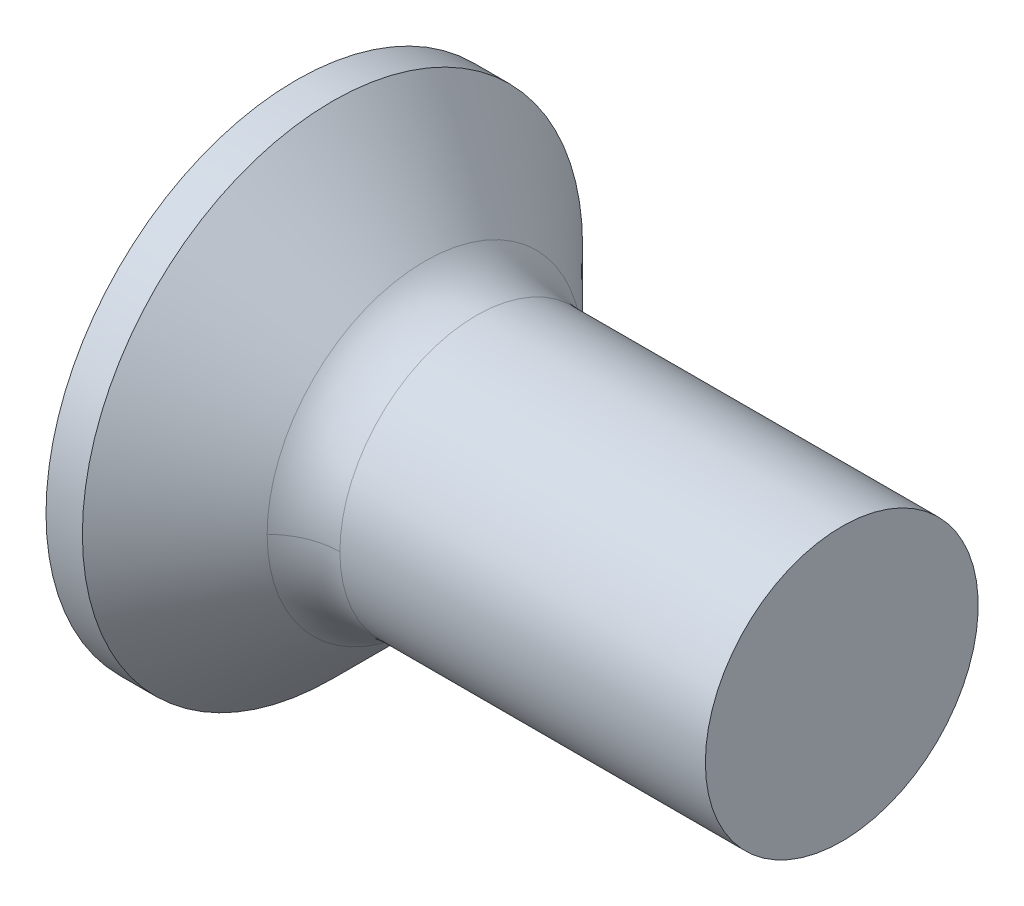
ISO-10303-21;
HEADER;
FILE_DESCRIPTION(('STEP AP214'),'2;1');
FILE_NAME('part.step','',(''),(''),'','','');
FILE_SCHEMA(('AUTOMOTIVE_DESIGN { 1 0 10303 214 1 1 1 1 }'));
ENDSEC;
DATA;
#1=APPLICATION_CONTEXT('core data for automotive mechanical design processes');
#2=APPLICATION_PROTOCOL_DEFINITION('international standard','automotive_design',2000,#1);
#3=PRODUCT_CONTEXT('',#1,'mechanical');
#4=PRODUCT('Part','Part','',(#3));
#5=PRODUCT_RELATED_PRODUCT_CATEGORY('part','',(#4));
#6=PRODUCT_DEFINITION_FORMATION('','',#4);
#7=PRODUCT_DEFINITION_CONTEXT('part definition',#1,'design');
#8=PRODUCT_DEFINITION('design','',#6,#7);
#9=PRODUCT_DEFINITION_SHAPE('','',#8);
#10=(LENGTH_UNIT() NAMED_UNIT(*) SI_UNIT(.MILLI.,.METRE.));
#11=(NAMED_UNIT(*) PLANE_ANGLE_UNIT() SI_UNIT($,.RADIAN.));
#12=(NAMED_UNIT(*) SI_UNIT($,.STERADIAN.) SOLID_ANGLE_UNIT());
#13=UNCERTAINTY_MEASURE_WITH_UNIT(LENGTH_MEASURE(1.E-05),#10,'distance_accuracy_value','');
#14=(GEOMETRIC_REPRESENTATION_CONTEXT(3) GLOBAL_UNCERTAINTY_ASSIGNED_CONTEXT((#13)) GLOBAL_UNIT_ASSIGNED_CONTEXT((#10,
#11,#12)) REPRESENTATION_CONTEXT('',''));
#15=CARTESIAN_POINT('',(0.,0.,0.));
#16=DIRECTION('',(0.,0.,1.));
#17=DIRECTION('',(1.,0.,0.));
#18=AXIS2_PLACEMENT_3D('',#15,#16,#17);
#19=CARTESIAN_POINT('',(2.01,0.,0.));
#20=DIRECTION('',(-1.,0.,0.));
#21=DIRECTION('',(0.,0.,1.));
#22=AXIS2_PLACEMENT_3D('',#19,#20,#21);
#23=CONICAL_SURFACE('',#22,0.556,0.069813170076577);
#24=CARTESIAN_POINT('',(2.01000000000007,0.,0.));
#25=DIRECTION('',(-1.,0.,0.));
#26=DIRECTION('',(-1.21680243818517E-13,0.,1.));
#27=AXIS2_PLACEMENT_3D('',#24,#25,#26);
#28=CIRCLE('',#27,0.556);
#29=CARTESIAN_POINT('',(2.01000000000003,0.370000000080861,-0.415013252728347));
#30=VERTEX_POINT('',#29);
#31=CARTESIAN_POINT('',(2.01000000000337,0.415013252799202,-0.370000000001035));
#32=VERTEX_POINT('',#31);
#33=EDGE_CURVE('E152',#30,#32,#28,.F.);
#34=ORIENTED_EDGE('',*,*,#33,.T.);
#35=CARTESIAN_POINT('',(2.93552142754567E-11,0.590157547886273,-0.369999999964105));
#36=CARTESIAN_POINT('',(0.216309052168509,0.572289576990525,-0.369999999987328));
#37=CARTESIAN_POINT('',(0.432602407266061,0.554222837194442,-0.369999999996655));
#38=CARTESIAN_POINT('',(0.865134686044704,0.517476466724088,-0.370000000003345));
#39=CARTESIAN_POINT('',(1.08137361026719,0.498796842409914,-0.370000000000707));
#40=CARTESIAN_POINT('',(1.41633940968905,0.469214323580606,-0.369999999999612));
#41=CARTESIAN_POINT('',(1.53509176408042,0.45860071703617,-0.369999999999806));
#42=CARTESIAN_POINT('',(1.77256859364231,0.437058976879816,-0.370000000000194));
#43=CARTESIAN_POINT('',(1.89129306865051,0.42613084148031,-0.370000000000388));
#44=CARTESIAN_POINT('',(2.01000000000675,0.415013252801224,-0.37));
#45=B_SPLINE_CURVE_WITH_KNOTS('',3,(#35,#36,#37,#38,#39,#40,#41,#42,#43,#44),.UNSPECIFIED.,.F.,
.F.,(4,2,2,2,4),(0.,0.651138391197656,1.30227002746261,1.65994677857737,2.01762556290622),.UNSPECIFIED.);
#46=CARTESIAN_POINT('',(0.,0.590157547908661,-0.37));
#47=VERTEX_POINT('',#46);
#48=EDGE_CURVE('E146',#47,#32,#45,.T.);
#49=ORIENTED_EDGE('',*,*,#48,.F.);
#50=CARTESIAN_POINT('',(0.,0.,0.));
#51=DIRECTION('',(-1.,0.,0.));
#52=DIRECTION('',(0.,0.,1.));
#53=AXIS2_PLACEMENT_3D('',#50,#51,#52);
#54=CIRCLE('',#53,0.696552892);
#55=CARTESIAN_POINT('',(1.36296545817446E-11,0.37,-0.590157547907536));
#56=VERTEX_POINT('',#55);
#57=EDGE_CURVE('E20',#47,#56,#54,.T.);
#58=ORIENTED_EDGE('',*,*,#57,.T.);
#59=CARTESIAN_POINT('',(2.01000000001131,0.370000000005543,-0.41501325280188));
#60=CARTESIAN_POINT('',(1.83750309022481,0.370000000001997,-0.431158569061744));
#61=CARTESIAN_POINT('',(1.66497088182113,0.370000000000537,-0.446919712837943));
#62=CARTESIAN_POINT('',(1.31985329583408,0.369999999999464,-0.477835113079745));
#63=CARTESIAN_POINT('',(1.14726791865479,0.369999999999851,-0.49298937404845));
#64=CARTESIAN_POINT('',(0.812249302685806,0.37000000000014,-0.521971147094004));
#65=CARTESIAN_POINT('',(0.649818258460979,0.37000000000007,-0.535824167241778));
#66=CARTESIAN_POINT('',(0.324928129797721,0.36999999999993,-0.563211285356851));
#67=CARTESIAN_POINT('',(0.162469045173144,0.36999999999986,-0.576745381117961));
#68=CARTESIAN_POINT('',(2.74379041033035E-11,0.37,-0.590157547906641));
#69=B_SPLINE_CURVE_WITH_KNOTS('',3,(#59,#60,#61,#62,#63,#64,#65,#66,#67,#68),.UNSPECIFIED.,.F.,
.F.,(4,2,2,2,4),(0.,0.519751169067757,1.0394984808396,1.52856030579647,2.01762551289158),.UNSPECIFIED.);
#70=EDGE_CURVE('E175',#30,#56,#69,.T.);
#71=ORIENTED_EDGE('',*,*,#70,.F.);
#72=EDGE_LOOP('',(#34,#49,#58,#71));
#73=FACE_BOUND('',#72,.T.);
#74=ADVANCED_FACE('F16',(#73),#23,.F.);
#75=CARTESIAN_POINT('',(0.,0.408503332,-0.37));
#76=DIRECTION('',(0.,0.,1.));
#77=DIRECTION('',(1.,0.,0.));
#78=AXIS2_PLACEMENT_3D('',#75,#76,#77);
#79=PLANE('',#78);
#80=DIRECTION('',(0.,1.,0.));
#81=VECTOR('',#80,1.);
#82=CARTESIAN_POINT('',(2.01,0.957506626,-0.37));
#83=LINE('',#82,#81);
#84=CARTESIAN_POINT('',(2.01000000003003,0.497851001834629,-0.37));
#85=VERTEX_POINT('',#84);
#86=EDGE_CURVE('E166',#32,#85,#83,.T.);
#87=ORIENTED_EDGE('',*,*,#86,.T.);
#88=DIRECTION('',(0.894934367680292,-0.446197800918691,0.));
#89=VECTOR('',#88,1.);
#90=CARTESIAN_POINT('',(1.005,0.998925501,-0.37));
#91=LINE('',#90,#89);
#92=CARTESIAN_POINT('',(1.56146074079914E-10,1.49999999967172,-0.37));
#93=VERTEX_POINT('',#92);
#94=EDGE_CURVE('E149',#93,#85,#91,.T.);
#95=ORIENTED_EDGE('',*,*,#94,.F.);
#96=DIRECTION('',(0.,-1.,0.));
#97=VECTOR('',#96,1.);
#98=CARTESIAN_POINT('',(0.,0.957506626,-0.37));
#99=LINE('',#98,#97);
#100=EDGE_CURVE('E141',#93,#47,#99,.T.);
#101=ORIENTED_EDGE('',*,*,#100,.T.);
#102=ORIENTED_EDGE('',*,*,#48,.T.);
#103=EDGE_LOOP('',(#87,#95,#101,#102));
#104=FACE_BOUND('',#103,.T.);
#105=ADVANCED_FACE('F144',(#104),#79,.T.);
#106=CARTESIAN_POINT('',(0.,0.37,-1.50650992));
#107=DIRECTION('',(0.,-1.,0.));
#108=DIRECTION('',(1.,0.,0.));
#109=AXIS2_PLACEMENT_3D('',#106,#107,#108);
#110=PLANE('',#109);
#111=DIRECTION('',(0.,0.,-1.));
#112=VECTOR('',#111,1.);
#113=CARTESIAN_POINT('',(0.,0.37,-0.957506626));
#114=LINE('',#113,#112);
#115=CARTESIAN_POINT('',(1.84218525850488E-10,0.37,-1.49999999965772));
#116=VERTEX_POINT('',#115);
#117=EDGE_CURVE('E161',#56,#116,#114,.T.);
#118=ORIENTED_EDGE('',*,*,#117,.T.);
#119=DIRECTION('',(-0.894934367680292,0.,-0.446197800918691));
#120=VECTOR('',#119,1.);
#121=CARTESIAN_POINT('',(1.005,0.37,-0.998925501));
#122=LINE('',#121,#120);
#123=CARTESIAN_POINT('',(2.01,0.37,-0.4978510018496));
#124=VERTEX_POINT('',#123);
#125=EDGE_CURVE('E472',#124,#116,#122,.T.);
#126=ORIENTED_EDGE('',*,*,#125,.F.);
#127=DIRECTION('',(0.,0.,1.));
#128=VECTOR('',#127,1.);
#129=CARTESIAN_POINT('',(2.01,0.37,-0.957506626));
#130=LINE('',#129,#128);
#131=EDGE_CURVE('E167',#124,#30,#130,.T.);
#132=ORIENTED_EDGE('',*,*,#131,.T.);
#133=ORIENTED_EDGE('',*,*,#70,.T.);
#134=EDGE_LOOP('',(#118,#126,#132,#133));
#135=FACE_BOUND('',#134,.T.);
#136=ADVANCED_FACE('F638',(#135),#110,.T.);
#137=CARTESIAN_POINT('',(6.,-1.518,1.518));
#138=DIRECTION('',(1.,0.,0.));
#139=DIRECTION('',(0.,0.,-1.));
#140=AXIS2_PLACEMENT_3D('',#137,#138,#139);
#141=PLANE('',#140);
#142=CARTESIAN_POINT('',(6.,0.,0.));
#143=DIRECTION('',(-1.,0.,0.));
#144=DIRECTION('',(0.,0.,1.));
#145=AXIS2_PLACEMENT_3D('',#142,#143,#144);
#146=CIRCLE('',#145,1.5);
#147=CARTESIAN_POINT('',(6.,0.,1.5));
#148=VERTEX_POINT('',#147);
#149=EDGE_CURVE('E460',#148,#148,#146,.F.);
#150=ORIENTED_EDGE('',*,*,#149,.T.);
#151=EDGE_LOOP('',(#150));
#152=FACE_BOUND('',#151,.T.);
#153=ADVANCED_FACE('F665',(#152),#141,.T.);
#154=CARTESIAN_POINT('',(0.,1.5,-0.37));
#155=DIRECTION('',(-0.446197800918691,-0.894934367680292,0.));
#156=DIRECTION('',(0.894934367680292,-0.446197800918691,0.));
#157=AXIS2_PLACEMENT_3D('',#154,#155,#156);
#158=PLANE('',#157);
#159=DIRECTION('',(0.,0.,-1.));
#160=VECTOR('',#159,1.);
#161=CARTESIAN_POINT('',(0.,1.5,0.));
#162=LINE('',#161,#160);
#163=CARTESIAN_POINT('',(0.,1.49999999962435,0.37));
#164=VERTEX_POINT('',#163);
#165=EDGE_CURVE('E484',#164,#93,#162,.T.);
#166=ORIENTED_EDGE('',*,*,#165,.T.);
#167=ORIENTED_EDGE('',*,*,#94,.T.);
#168=DIRECTION('',(0.,0.,1.));
#169=VECTOR('',#168,1.);
#170=CARTESIAN_POINT('',(2.01,0.497851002,0.));
#171=LINE('',#170,#169);
#172=CARTESIAN_POINT('',(2.01000000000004,0.49785100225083,-0.247548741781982));
#173=VERTEX_POINT('',#172);
#174=EDGE_CURVE('E486',#85,#173,#171,.T.);
#175=ORIENTED_EDGE('',*,*,#174,.T.);
#176=CARTESIAN_POINT('',(2.86902882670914,0.0695550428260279,0.));
#177=DIRECTION('',(-0.446197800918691,-0.894934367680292,0.));
#178=DIRECTION('',(-0.894934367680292,0.446197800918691,0.));
#179=AXIS2_PLACEMENT_3D('',#176,#177,#178);
#180=ELLIPSE('',#179,1.111459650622,0.491029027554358);
#181=CARTESIAN_POINT('',(2.01000000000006,0.497851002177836,0.247548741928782));
#182=VERTEX_POINT('',#181);
#183=EDGE_CURVE('E485',#173,#182,#180,.F.);
#184=ORIENTED_EDGE('',*,*,#183,.T.);
#185=DIRECTION('',(0.,0.,1.));
#186=VECTOR('',#185,1.);
#187=CARTESIAN_POINT('',(2.01,0.497851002,0.));
#188=LINE('',#187,#186);
#189=CARTESIAN_POINT('',(2.01,0.4978510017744,0.37));
#190=VERTEX_POINT('',#189);
#191=EDGE_CURVE('E482',#182,#190,#188,.T.);
#192=ORIENTED_EDGE('',*,*,#191,.T.);
#193=DIRECTION('',(0.894934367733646,-0.446197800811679,0.));
#194=VECTOR('',#193,1.);
#195=CARTESIAN_POINT('',(0.,1.49999999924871,0.37));
#196=LINE('',#195,#194);
#197=EDGE_CURVE('E455',#164,#190,#196,.T.);
#198=ORIENTED_EDGE('',*,*,#197,.F.);
#199=EDGE_LOOP('',(#166,#167,#175,#184,#192,#198));
#200=FACE_BOUND('',#199,.T.);
#201=ADVANCED_FACE('F596',(#200),#158,.T.);
#202=CARTESIAN_POINT('',(2.01,0.37,-0.497851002));
#203=DIRECTION('',(-0.446197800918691,0.,0.894934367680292));
#204=DIRECTION('',(-0.894934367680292,0.,-0.446197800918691));
#205=AXIS2_PLACEMENT_3D('',#202,#203,#204);
#206=PLANE('',#205);
#207=DIRECTION('',(0.,-1.,0.));
#208=VECTOR('',#207,1.);
#209=CARTESIAN_POINT('',(0.,0.,-1.5));
#210=LINE('',#209,#208);
#211=CARTESIAN_POINT('',(0.,-0.37,-1.49999999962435));
#212=VERTEX_POINT('',#211);
#213=EDGE_CURVE('E478',#116,#212,#210,.T.);
#214=ORIENTED_EDGE('',*,*,#213,.T.);
#215=DIRECTION('',(-0.894934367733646,0.,-0.446197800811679));
#216=VECTOR('',#215,1.);
#217=CARTESIAN_POINT('',(2.01,-0.37,-0.497851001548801));
#218=LINE('',#217,#216);
#219=CARTESIAN_POINT('',(2.01,-0.37,-0.497851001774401));
#220=VERTEX_POINT('',#219);
#221=EDGE_CURVE('E452',#220,#212,#218,.T.);
#222=ORIENTED_EDGE('',*,*,#221,.F.);
#223=DIRECTION('',(0.,1.,0.));
#224=VECTOR('',#223,1.);
#225=CARTESIAN_POINT('',(2.01,0.,-0.497851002));
#226=LINE('',#225,#224);
#227=CARTESIAN_POINT('',(2.01000000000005,-0.247548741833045,-0.49785100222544));
#228=VERTEX_POINT('',#227);
#229=EDGE_CURVE('E476',#220,#228,#226,.T.);
#230=ORIENTED_EDGE('',*,*,#229,.T.);
#231=CARTESIAN_POINT('',(2.86902882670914,0.,-0.0695550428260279));
#232=DIRECTION('',(-0.446197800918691,0.,0.894934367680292));
#233=DIRECTION('',(-0.894934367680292,0.,-0.446197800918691));
#234=AXIS2_PLACEMENT_3D('',#231,#232,#233);
#235=ELLIPSE('',#234,1.111459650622,0.491029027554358);
#236=CARTESIAN_POINT('',(2.01000000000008,0.247548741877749,-0.497851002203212));
#237=VERTEX_POINT('',#236);
#238=EDGE_CURVE('E473',#228,#237,#235,.F.);
#239=ORIENTED_EDGE('',*,*,#238,.T.);
#240=DIRECTION('',(0.,1.,0.));
#241=VECTOR('',#240,1.);
#242=CARTESIAN_POINT('',(2.01,0.,-0.497851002));
#243=LINE('',#242,#241);
#244=EDGE_CURVE('E469',#237,#124,#243,.T.);
#245=ORIENTED_EDGE('',*,*,#244,.T.);
#246=ORIENTED_EDGE('',*,*,#125,.T.);
#247=EDGE_LOOP('',(#214,#222,#230,#239,#245,#246));
#248=FACE_BOUND('',#247,.T.);
#249=ADVANCED_FACE('F190',(#248),#206,.T.);
#250=CARTESIAN_POINT('',(6.,0.,0.));
#251=DIRECTION('',(-1.,0.,0.));
#252=DIRECTION('',(0.,0.,1.));
#253=AXIS2_PLACEMENT_3D('',#250,#251,#252);
#254=CYLINDRICAL_SURFACE('',#253,1.5);
#255=ORIENTED_EDGE('',*,*,#149,.F.);
#256=EDGE_LOOP('',(#255));
#257=FACE_BOUND('',#256,.T.);
#258=CARTESIAN_POINT('',(1.98137084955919,0.,0.));
#259=DIRECTION('',(1.,0.,0.));
#260=DIRECTION('',(0.,1.,0.));
#261=AXIS2_PLACEMENT_3D('',#258,#259,#260);
#262=CIRCLE('',#261,1.50000000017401);
#263=CARTESIAN_POINT('',(1.98137084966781,-1.53827571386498E-10,-1.50000000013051));
#264=VERTEX_POINT('',#263);
#265=CARTESIAN_POINT('',(1.98137084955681,-6.73452213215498E-11,1.50000000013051));
#266=VERTEX_POINT('',#265);
#267=EDGE_CURVE('E442',#264,#266,#262,.T.);
#268=ORIENTED_EDGE('',*,*,#267,.T.);
#269=CARTESIAN_POINT('',(1.98137084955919,0.,0.));
#270=DIRECTION('',(1.,0.,0.));
#271=DIRECTION('',(0.,1.,0.));
#272=AXIS2_PLACEMENT_3D('',#269,#270,#271);
#273=CIRCLE('',#272,1.50000000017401);
#274=EDGE_CURVE('E431',#266,#264,#273,.T.);
#275=ORIENTED_EDGE('',*,*,#274,.T.);
#276=EDGE_LOOP('',(#268,#275));
#277=FACE_BOUND('',#276,.T.);
#278=ADVANCED_FACE('F185',(#257,#277),#254,.T.);
#279=CARTESIAN_POINT('',(0.,0.408503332,0.37));
#280=DIRECTION('',(0.,0.,-1.));
#281=DIRECTION('',(0.,1.,0.));
#282=AXIS2_PLACEMENT_3D('',#279,#280,#281);
#283=PLANE('',#282);
#284=DIRECTION('',(0.,1.,0.));
#285=VECTOR('',#284,1.);
#286=CARTESIAN_POINT('',(0.,0.957506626,0.37));
#287=LINE('',#286,#285);
#288=CARTESIAN_POINT('',(0.,0.590157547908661,0.37));
#289=VERTEX_POINT('',#288);
#290=EDGE_CURVE('E456',#289,#164,#287,.T.);
#291=ORIENTED_EDGE('',*,*,#290,.T.);
#292=ORIENTED_EDGE('',*,*,#197,.T.);
#293=DIRECTION('',(0.,-1.,0.));
#294=VECTOR('',#293,1.);
#295=CARTESIAN_POINT('',(2.01,0.957506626,0.37));
#296=LINE('',#295,#294);
#297=CARTESIAN_POINT('',(2.01000000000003,0.415013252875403,0.369999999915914));
#298=VERTEX_POINT('',#297);
#299=EDGE_CURVE('E458',#190,#298,#296,.T.);
#300=ORIENTED_EDGE('',*,*,#299,.T.);
#301=CARTESIAN_POINT('',(1.89001292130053E-11,0.590157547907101,0.37));
#302=CARTESIAN_POINT('',(0.216309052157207,0.572289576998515,0.37));
#303=CARTESIAN_POINT('',(0.432602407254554,0.55422283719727,0.37));
#304=CARTESIAN_POINT('',(0.86513468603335,0.517476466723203,0.37));
#305=CARTESIAN_POINT('',(1.08137361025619,0.498796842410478,0.37));
#306=CARTESIAN_POINT('',(1.41633940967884,0.469214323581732,0.37));
#307=CARTESIAN_POINT('',(1.5350917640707,0.458600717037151,0.37));
#308=CARTESIAN_POINT('',(1.77256859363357,0.437058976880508,0.37));
#309=CARTESIAN_POINT('',(1.89129306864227,0.426130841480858,0.37));
#310=CARTESIAN_POINT('',(2.00999999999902,0.415013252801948,0.37));
#311=B_SPLINE_CURVE_WITH_KNOTS('',3,(#301,#302,#303,#304,#305,#306,#307,#308,#309,#310),
.UNSPECIFIED.,.F.,.F.,(4,2,2,2,4),(0.,0.651138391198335,1.302270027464,1.65994677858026,
2.01762556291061),.UNSPECIFIED.);
#312=EDGE_CURVE('E225',#289,#298,#311,.T.);
#313=ORIENTED_EDGE('',*,*,#312,.F.);
#314=EDGE_LOOP('',(#291,#292,#300,#313));
#315=FACE_BOUND('',#314,.T.);
#316=ADVANCED_FACE('F189',(#315),#283,.T.);
#317=CARTESIAN_POINT('',(0.,-0.37,-1.50650992));
#318=DIRECTION('',(0.,1.,0.));
#319=DIRECTION('',(0.,0.,1.));
#320=AXIS2_PLACEMENT_3D('',#317,#318,#319);
#321=PLANE('',#320);
#322=DIRECTION('',(0.,0.,-1.));
#323=VECTOR('',#322,1.);
#324=CARTESIAN_POINT('',(2.01,-0.37,-0.957506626));
#325=LINE('',#324,#323);
#326=CARTESIAN_POINT('',(2.01000000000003,-0.370000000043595,-0.415013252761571));
#327=VERTEX_POINT('',#326);
#328=EDGE_CURVE('E447',#327,#220,#325,.T.);
#329=ORIENTED_EDGE('',*,*,#328,.T.);
#330=ORIENTED_EDGE('',*,*,#221,.T.);
#331=DIRECTION('',(0.,0.,1.));
#332=VECTOR('',#331,1.);
#333=CARTESIAN_POINT('',(0.,-0.37,-0.957506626));
#334=LINE('',#333,#332);
#335=CARTESIAN_POINT('',(1.31826469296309E-11,-0.37,-0.590157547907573));
#336=VERTEX_POINT('',#335);
#337=EDGE_CURVE('E453',#212,#336,#334,.T.);
#338=ORIENTED_EDGE('',*,*,#337,.T.);
#339=CARTESIAN_POINT('',(2.0100000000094,-0.369999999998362,-0.415013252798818));
#340=CARTESIAN_POINT('',(1.83750309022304,-0.36999999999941,-0.431158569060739));
#341=CARTESIAN_POINT('',(1.6649708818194,-0.369999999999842,-0.446919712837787));
#342=CARTESIAN_POINT('',(1.31985329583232,-0.370000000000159,-0.477835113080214));
#343=CARTESIAN_POINT('',(1.14726791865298,-0.370000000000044,-0.492989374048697));
#344=CARTESIAN_POINT('',(0.81224930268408,-0.369999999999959,-0.52197114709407));
#345=CARTESIAN_POINT('',(0.649818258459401,-0.369999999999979,-0.535824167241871));
#346=CARTESIAN_POINT('',(0.324928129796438,-0.370000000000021,-0.563211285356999));
#347=CARTESIAN_POINT('',(0.162469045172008,-0.370000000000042,-0.576745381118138));
#348=CARTESIAN_POINT('',(2.64376629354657E-11,-0.37,-0.590157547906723));
#349=B_SPLINE_CURVE_WITH_KNOTS('',3,(#339,#340,#341,#342,#343,#344,#345,#346,#347,#348),
.UNSPECIFIED.,.F.,.F.,(4,2,2,2,4),(0.,0.519751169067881,1.03949848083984,1.52856030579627,
2.01762551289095),.UNSPECIFIED.);
#350=EDGE_CURVE('E415',#327,#336,#349,.T.);
#351=ORIENTED_EDGE('',*,*,#350,.F.);
#352=EDGE_LOOP('',(#329,#330,#338,#351));
#353=FACE_BOUND('',#352,.T.);
#354=ADVANCED_FACE('F198',(#353),#321,.T.);
#355=CARTESIAN_POINT('',(2.061237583,0.,1.503996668));
#356=CARTESIAN_POINT('',(2.061237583,3.007993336,1.503996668));
#357=CARTESIAN_POINT('',(2.061237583,3.007993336,-1.503996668));
#358=CARTESIAN_POINT('',(2.061237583,0.,-1.503996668));
#359=CARTESIAN_POINT('',(1.788610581,0.,1.476642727));
#360=CARTESIAN_POINT('',(1.788610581,2.953285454,1.476642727));
#361=CARTESIAN_POINT('',(1.788610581,2.953285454,-1.476642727));
#362=CARTESIAN_POINT('',(1.788610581,0.,-1.476642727));
#363=CARTESIAN_POINT('',(1.535471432,0.,1.581496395));
#364=CARTESIAN_POINT('',(1.535471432,3.162992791,1.581496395));
#365=CARTESIAN_POINT('',(1.535471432,3.162992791,-1.581496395));
#366=CARTESIAN_POINT('',(1.535471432,0.,-1.581496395));
#367=CARTESIAN_POINT('',(1.362037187,0.,1.793614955));
#368=CARTESIAN_POINT('',(1.362037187,3.587229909,1.793614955));
#369=CARTESIAN_POINT('',(1.362037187,3.587229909,-1.793614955));
#370=CARTESIAN_POINT('',(1.362037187,0.,-1.793614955));
#371=(BOUNDED_SURFACE() B_SPLINE_SURFACE(3,3,((#355,#356,#357,#358),(#359,#360,#361,#362),(#363,
#364,#365,#366),(#367,#368,#369,#370)),.UNSPECIFIED.,.F.,.F.,
.F.) B_SPLINE_SURFACE_WITH_KNOTS((4,4),(4,4),(0.,1.),(0.,1.),
.UNSPECIFIED.) GEOMETRIC_REPRESENTATION_ITEM() RATIONAL_B_SPLINE_SURFACE(((1.,0.333333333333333,
0.333333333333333,1.),(0.920706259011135,0.306902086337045,0.306902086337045,0.920706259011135),
(0.920706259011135,0.306902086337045,0.306902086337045,0.920706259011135),(1.,0.333333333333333,
0.333333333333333,1.))) REPRESENTATION_ITEM('') SURFACE());
#372=CARTESIAN_POINT('',(1.41568542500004,0.,0.));
#373=DIRECTION('',(-1.,0.,0.));
#374=DIRECTION('',(0.,0.,1.));
#375=AXIS2_PLACEMENT_3D('',#372,#373,#374);
#376=CIRCLE('',#375,1.734314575);
#377=CARTESIAN_POINT('',(1.41568542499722,-5.3357079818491E-10,-1.73431457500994));
#378=VERTEX_POINT('',#377);
#379=CARTESIAN_POINT('',(1.41568542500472,-1.55730398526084E-10,1.73431457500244));
#380=VERTEX_POINT('',#379);
#381=EDGE_CURVE('E420',#378,#380,#376,.F.);
#382=CARTESIAN_POINT('',(2.061237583,0.,1.503996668));
#383=CARTESIAN_POINT('',(1.788610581,0.,1.476642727));
#384=CARTESIAN_POINT('',(1.535471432,0.,1.581496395));
#385=CARTESIAN_POINT('',(1.362037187,0.,1.793614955));
#386=(BOUNDED_CURVE() B_SPLINE_CURVE(3,(#382,#383,#384,#385),.UNSPECIFIED.,.F.,
.F.) B_SPLINE_CURVE_WITH_KNOTS((4,4),(0.,1.),
.UNSPECIFIED.) CURVE() GEOMETRIC_REPRESENTATION_ITEM() RATIONAL_B_SPLINE_CURVE((1.,
0.920706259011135,0.920706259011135,1.)) REPRESENTATION_ITEM(''));
#387=EDGE_CURVE('E436',#380,#266,#386,.F.);
#388=CARTESIAN_POINT('',(2.061237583,0.,-1.503996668));
#389=CARTESIAN_POINT('',(1.788610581,0.,-1.476642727));
#390=CARTESIAN_POINT('',(1.535471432,0.,-1.581496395));
#391=CARTESIAN_POINT('',(1.362037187,0.,-1.793614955));
#392=(BOUNDED_CURVE() B_SPLINE_CURVE(3,(#388,#389,#390,#391),.UNSPECIFIED.,.F.,
.F.) B_SPLINE_CURVE_WITH_KNOTS((4,4),(0.,1.),
.UNSPECIFIED.) CURVE() GEOMETRIC_REPRESENTATION_ITEM() RATIONAL_B_SPLINE_CURVE((1.,
0.920706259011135,0.920706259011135,1.)) REPRESENTATION_ITEM(''));
#393=EDGE_CURVE('E419',#264,#378,#392,.T.);
#394=ORIENTED_EDGE('',*,*,#381,.T.);
#395=ORIENTED_EDGE('',*,*,#387,.T.);
#396=ORIENTED_EDGE('',*,*,#267,.F.);
#397=ORIENTED_EDGE('',*,*,#393,.T.);
#398=EDGE_LOOP('',(#394,#395,#396,#397));
#399=FACE_BOUND('',#398,.T.);
#400=ADVANCED_FACE('F192',(#399),#371,.F.);
#401=CARTESIAN_POINT('',(2.061237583,0.,-1.503996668));
#402=CARTESIAN_POINT('',(2.061237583,-3.007993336,-1.503996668));
#403=CARTESIAN_POINT('',(2.061237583,-3.007993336,1.503996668));
#404=CARTESIAN_POINT('',(2.061237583,0.,1.503996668));
#405=CARTESIAN_POINT('',(1.788610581,0.,-1.476642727));
#406=CARTESIAN_POINT('',(1.788610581,-2.953285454,-1.476642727));
#407=CARTESIAN_POINT('',(1.788610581,-2.953285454,1.476642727));
#408=CARTESIAN_POINT('',(1.788610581,0.,1.476642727));
#409=CARTESIAN_POINT('',(1.535471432,0.,-1.581496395));
#410=CARTESIAN_POINT('',(1.535471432,-3.162992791,-1.581496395));
#411=CARTESIAN_POINT('',(1.535471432,-3.162992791,1.581496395));
#412=CARTESIAN_POINT('',(1.535471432,0.,1.581496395));
#413=CARTESIAN_POINT('',(1.362037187,0.,-1.793614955));
#414=CARTESIAN_POINT('',(1.362037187,-3.587229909,-1.793614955));
#415=CARTESIAN_POINT('',(1.362037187,-3.587229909,1.793614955));
#416=CARTESIAN_POINT('',(1.362037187,0.,1.793614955));
#417=(BOUNDED_SURFACE() B_SPLINE_SURFACE(3,3,((#401,#402,#403,#404),(#405,#406,#407,#408),(#409,
#410,#411,#412),(#413,#414,#415,#416)),.UNSPECIFIED.,.F.,.F.,
.F.) B_SPLINE_SURFACE_WITH_KNOTS((4,4),(4,4),(0.,1.),(0.,1.),
.UNSPECIFIED.) GEOMETRIC_REPRESENTATION_ITEM() RATIONAL_B_SPLINE_SURFACE(((1.,0.333333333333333,
0.333333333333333,1.),(0.920706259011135,0.306902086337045,0.306902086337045,0.920706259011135),
(0.920706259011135,0.306902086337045,0.306902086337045,0.920706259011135),(1.,0.333333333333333,
0.333333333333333,1.))) REPRESENTATION_ITEM('') SURFACE());
#418=CARTESIAN_POINT('',(1.41568542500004,0.,0.));
#419=DIRECTION('',(-1.,0.,0.));
#420=DIRECTION('',(0.,0.,1.));
#421=AXIS2_PLACEMENT_3D('',#418,#419,#420);
#422=CIRCLE('',#421,1.734314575);
#423=EDGE_CURVE('E408',#380,#378,#422,.F.);
#424=ORIENTED_EDGE('',*,*,#393,.F.);
#425=ORIENTED_EDGE('',*,*,#274,.F.);
#426=ORIENTED_EDGE('',*,*,#387,.F.);
#427=ORIENTED_EDGE('',*,*,#423,.T.);
#428=EDGE_LOOP('',(#424,#425,#426,#427));
#429=FACE_BOUND('',#428,.T.);
#430=ADVANCED_FACE('F197',(#429),#417,.F.);
#431=CARTESIAN_POINT('',(2.01,0.,0.));
#432=DIRECTION('',(-1.,0.,0.));
#433=DIRECTION('',(0.,0.,1.));
#434=AXIS2_PLACEMENT_3D('',#431,#432,#433);
#435=CONICAL_SURFACE('',#434,0.556,0.069813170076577);
#436=CARTESIAN_POINT('',(0.,0.,0.));
#437=DIRECTION('',(-1.,0.,0.));
#438=DIRECTION('',(0.,0.,1.));
#439=AXIS2_PLACEMENT_3D('',#436,#437,#438);
#440=CIRCLE('',#439,0.696552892);
#441=CARTESIAN_POINT('',(0.,0.37,0.590157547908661));
#442=VERTEX_POINT('',#441);
#443=EDGE_CURVE('E418',#442,#289,#440,.T.);
#444=ORIENTED_EDGE('',*,*,#443,.T.);
#445=ORIENTED_EDGE('',*,*,#312,.T.);
#446=CARTESIAN_POINT('',(2.01000000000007,0.,0.));
#447=DIRECTION('',(-1.,0.,0.));
#448=DIRECTION('',(-1.21680243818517E-13,0.,1.));
#449=AXIS2_PLACEMENT_3D('',#446,#447,#448);
#450=CIRCLE('',#449,0.556);
#451=CARTESIAN_POINT('',(2.0100000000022,0.369999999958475,0.415013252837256));
#452=VERTEX_POINT('',#451);
#453=EDGE_CURVE('E416',#298,#452,#450,.F.);
#454=ORIENTED_EDGE('',*,*,#453,.T.);
#455=CARTESIAN_POINT('',(2.75591331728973E-11,0.369999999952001,0.590157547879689));
#456=CARTESIAN_POINT('',(0.216309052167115,0.369999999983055,0.572289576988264));
#457=CARTESIAN_POINT('',(0.432602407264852,0.369999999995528,0.554222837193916));
#458=CARTESIAN_POINT('',(0.865134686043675,0.370000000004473,0.517476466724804));
#459=CARTESIAN_POINT('',(1.08137361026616,0.370000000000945,0.498796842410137));
#460=CARTESIAN_POINT('',(1.41633940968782,0.369999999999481,0.469214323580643));
#461=CARTESIAN_POINT('',(1.53509176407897,0.36999999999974,0.458600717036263));
#462=CARTESIAN_POINT('',(1.77256859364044,0.37000000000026,0.437058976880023));
#463=CARTESIAN_POINT('',(1.89129306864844,0.370000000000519,0.426130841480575));
#464=CARTESIAN_POINT('',(2.01000000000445,0.37,0.41501325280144));
#465=B_SPLINE_CURVE_WITH_KNOTS('',3,(#455,#456,#457,#458,#459,#460,#461,#462,#463,#464),
.UNSPECIFIED.,.F.,.F.,(4,2,2,2,4),(0.,0.651138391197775,1.30227002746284,1.65994677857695,
2.01762556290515),.UNSPECIFIED.);
#466=EDGE_CURVE('E233',#442,#452,#465,.T.);
#467=ORIENTED_EDGE('',*,*,#466,.F.);
#468=EDGE_LOOP('',(#444,#445,#454,#467));
#469=FACE_BOUND('',#468,.T.);
#470=ADVANCED_FACE('F209',(#469),#435,.F.);
#471=CARTESIAN_POINT('',(2.01,0.,0.));
#472=DIRECTION('',(-1.,0.,0.));
#473=DIRECTION('',(0.,0.,1.));
#474=AXIS2_PLACEMENT_3D('',#471,#472,#473);
#475=CONICAL_SURFACE('',#474,0.556,0.069813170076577);
#476=CARTESIAN_POINT('',(0.,0.,0.));
#477=DIRECTION('',(-1.,0.,0.));
#478=DIRECTION('',(0.,0.,1.));
#479=AXIS2_PLACEMENT_3D('',#476,#477,#478);
#480=CIRCLE('',#479,0.696552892);
#481=CARTESIAN_POINT('',(1.60406412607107E-11,-0.590157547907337,-0.37));
#482=VERTEX_POINT('',#481);
#483=EDGE_CURVE('E249',#336,#482,#480,.T.);
#484=ORIENTED_EDGE('',*,*,#483,.T.);
#485=CARTESIAN_POINT('',(2.01000000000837,-0.415013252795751,-0.369999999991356));
#486=CARTESIAN_POINT('',(1.83750309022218,-0.43115856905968,-0.369999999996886));
#487=CARTESIAN_POINT('',(1.66497088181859,-0.446919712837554,-0.369999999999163));
#488=CARTESIAN_POINT('',(1.31985329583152,-0.477835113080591,-0.370000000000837));
#489=CARTESIAN_POINT('',(1.14726791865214,-0.492989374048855,-0.370000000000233));
#490=CARTESIAN_POINT('',(0.812249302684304,-0.52197114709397,-0.369999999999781));
#491=CARTESIAN_POINT('',(0.649818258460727,-0.535824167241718,-0.36999999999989));
#492=CARTESIAN_POINT('',(0.324928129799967,-0.563211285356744,-0.37000000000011));
#493=CARTESIAN_POINT('',(0.162469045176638,-0.576745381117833,-0.370000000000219));
#494=CARTESIAN_POINT('',(3.21574312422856E-11,-0.590157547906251,-0.37));
#495=B_SPLINE_CURVE_WITH_KNOTS('',3,(#485,#486,#487,#488,#489,#490,#491,#492,#493,#494),
.UNSPECIFIED.,.F.,.F.,(4,2,2,2,4),(0.,0.519751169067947,1.03949848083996,1.52856030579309,
2.01762551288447),.UNSPECIFIED.);
#496=CARTESIAN_POINT('',(2.01000000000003,-0.415013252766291,-0.370000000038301));
#497=VERTEX_POINT('',#496);
#498=EDGE_CURVE('E243',#497,#482,#495,.T.);
#499=ORIENTED_EDGE('',*,*,#498,.F.);
#500=CARTESIAN_POINT('',(2.01000000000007,0.,0.));
#501=DIRECTION('',(-1.,0.,0.));
#502=DIRECTION('',(-1.21680243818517E-13,0.,1.));
#503=AXIS2_PLACEMENT_3D('',#500,#501,#502);
#504=CIRCLE('',#503,0.556);
#505=EDGE_CURVE('E413',#497,#327,#504,.F.);
#506=ORIENTED_EDGE('',*,*,#505,.T.);
#507=ORIENTED_EDGE('',*,*,#350,.T.);
#508=EDGE_LOOP('',(#484,#499,#506,#507));
#509=FACE_BOUND('',#508,.T.);
#510=ADVANCED_FACE('F219',(#509),#475,.F.);
#511=CARTESIAN_POINT('',(1.415685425,0.,0.));
#512=DIRECTION('',(-1.,0.,0.));
#513=DIRECTION('',(0.,0.,1.));
#514=AXIS2_PLACEMENT_3D('',#511,#512,#513);
#515=CONICAL_SURFACE('',#514,1.734314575,0.785398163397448);
#516=ORIENTED_EDGE('',*,*,#423,.F.);
#517=ORIENTED_EDGE('',*,*,#381,.F.);
#518=EDGE_LOOP('',(#516,#517));
#519=FACE_BOUND('',#518,.T.);
#520=CARTESIAN_POINT('',(0.4,0.,0.));
#521=DIRECTION('',(-1.,0.,0.));
#522=DIRECTION('',(0.,0.,1.));
#523=AXIS2_PLACEMENT_3D('',#520,#521,#522);
#524=CIRCLE('',#523,2.75);
#525=CARTESIAN_POINT('',(0.4,0.,2.75));
#526=VERTEX_POINT('',#525);
#527=EDGE_CURVE('E375',#526,#526,#524,.F.);
#528=ORIENTED_EDGE('',*,*,#527,.T.);
#529=EDGE_LOOP('',(#528));
#530=FACE_BOUND('',#529,.T.);
#531=ADVANCED_FACE('F255',(#519,#530),#515,.T.);
#532=CARTESIAN_POINT('',(0.,0.37,0.408503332));
#533=DIRECTION('',(0.,-1.,0.));
#534=DIRECTION('',(1.,0.,0.));
#535=AXIS2_PLACEMENT_3D('',#532,#533,#534);
#536=PLANE('',#535);
#537=DIRECTION('',(0.,0.,1.));
#538=VECTOR('',#537,1.);
#539=CARTESIAN_POINT('',(2.01,0.37,0.957506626));
#540=LINE('',#539,#538);
#541=CARTESIAN_POINT('',(2.01,0.37,0.4978510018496));
#542=VERTEX_POINT('',#541);
#543=EDGE_CURVE('E241',#452,#542,#540,.T.);
#544=ORIENTED_EDGE('',*,*,#543,.T.);
#545=DIRECTION('',(0.894934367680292,0.,-0.446197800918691));
#546=VECTOR('',#545,1.);
#547=CARTESIAN_POINT('',(1.005,0.37,0.998925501));
#548=LINE('',#547,#546);
#549=CARTESIAN_POINT('',(3.68437051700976E-10,0.370000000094,1.49999999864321));
#550=VERTEX_POINT('',#549);
#551=EDGE_CURVE('E369',#550,#542,#548,.T.);
#552=ORIENTED_EDGE('',*,*,#551,.F.);
#553=DIRECTION('',(0.,0.,-1.));
#554=VECTOR('',#553,1.);
#555=CARTESIAN_POINT('',(0.,0.37,0.957506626));
#556=LINE('',#555,#554);
#557=EDGE_CURVE('E242',#550,#442,#556,.T.);
#558=ORIENTED_EDGE('',*,*,#557,.T.);
#559=ORIENTED_EDGE('',*,*,#466,.T.);
#560=EDGE_LOOP('',(#544,#552,#558,#559));
#561=FACE_BOUND('',#560,.T.);
#562=ADVANCED_FACE('F250',(#561),#536,.T.);
#563=CARTESIAN_POINT('',(0.,-1.50650992,-0.37));
#564=DIRECTION('',(0.,0.,1.));
#565=DIRECTION('',(1.,0.,0.));
#566=AXIS2_PLACEMENT_3D('',#563,#564,#565);
#567=PLANE('',#566);
#568=DIRECTION('',(0.,-1.,0.));
#569=VECTOR('',#568,1.);
#570=CARTESIAN_POINT('',(0.,-0.957506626,-0.37));
#571=LINE('',#570,#569);
#572=CARTESIAN_POINT('',(3.68437051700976E-10,-1.49999999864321,-0.370000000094));
#573=VERTEX_POINT('',#572);
#574=EDGE_CURVE('E394',#482,#573,#571,.T.);
#575=ORIENTED_EDGE('',*,*,#574,.T.);
#576=DIRECTION('',(-0.894934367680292,-0.446197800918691,0.));
#577=VECTOR('',#576,1.);
#578=CARTESIAN_POINT('',(1.005,-0.998925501,-0.37));
#579=LINE('',#578,#577);
#580=CARTESIAN_POINT('',(2.01,-0.4978510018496,-0.37));
#581=VERTEX_POINT('',#580);
#582=EDGE_CURVE('E387',#581,#573,#579,.T.);
#583=ORIENTED_EDGE('',*,*,#582,.F.);
#584=DIRECTION('',(0.,1.,0.));
#585=VECTOR('',#584,1.);
#586=CARTESIAN_POINT('',(2.01,-0.957506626,-0.37));
#587=LINE('',#586,#585);
#588=EDGE_CURVE('E399',#581,#497,#587,.T.);
#589=ORIENTED_EDGE('',*,*,#588,.T.);
#590=ORIENTED_EDGE('',*,*,#498,.T.);
#591=EDGE_LOOP('',(#575,#583,#589,#590));
#592=FACE_BOUND('',#591,.T.);
#593=ADVANCED_FACE('F254',(#592),#567,.T.);
#594=CARTESIAN_POINT('',(0.4,0.,0.));
#595=DIRECTION('',(-1.,0.,0.));
#596=DIRECTION('',(0.,0.,1.));
#597=AXIS2_PLACEMENT_3D('',#594,#595,#596);
#598=CYLINDRICAL_SURFACE('',#597,2.75);
#599=ORIENTED_EDGE('',*,*,#527,.F.);
#600=EDGE_LOOP('',(#599));
#601=FACE_BOUND('',#600,.T.);
#602=CARTESIAN_POINT('',(0.,0.,0.));
#603=DIRECTION('',(-1.,0.,0.));
#604=DIRECTION('',(0.,0.,1.));
#605=AXIS2_PLACEMENT_3D('',#602,#603,#604);
#606=CIRCLE('',#605,2.75);
#607=CARTESIAN_POINT('',(0.,0.,2.75));
#608=VERTEX_POINT('',#607);
#609=EDGE_CURVE('E547',#608,#608,#606,.T.);
#610=ORIENTED_EDGE('',*,*,#609,.F.);
#611=EDGE_LOOP('',(#610));
#612=FACE_BOUND('',#611,.T.);
#613=ADVANCED_FACE('F261',(#601,#612),#598,.T.);
#614=CARTESIAN_POINT('',(0.,0.37,1.5));
#615=DIRECTION('',(-0.446197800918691,0.,-0.894934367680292));
#616=DIRECTION('',(0.894934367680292,0.,-0.446197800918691));
#617=AXIS2_PLACEMENT_3D('',#614,#615,#616);
#618=PLANE('',#617);
#619=DIRECTION('',(0.,-1.,0.));
#620=VECTOR('',#619,1.);
#621=CARTESIAN_POINT('',(0.,0.,1.499999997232));
#622=LINE('',#621,#620);
#623=CARTESIAN_POINT('',(0.,-0.37,1.49999999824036));
#624=VERTEX_POINT('',#623);
#625=EDGE_CURVE('E380',#550,#624,#622,.T.);
#626=ORIENTED_EDGE('',*,*,#625,.F.);
#627=ORIENTED_EDGE('',*,*,#551,.T.);
#628=DIRECTION('',(0.,-1.,0.));
#629=VECTOR('',#628,1.);
#630=CARTESIAN_POINT('',(2.01,0.308407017,0.497851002));
#631=LINE('',#630,#629);
#632=CARTESIAN_POINT('',(2.01000000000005,0.24754874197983,0.497851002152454));
#633=VERTEX_POINT('',#632);
#634=EDGE_CURVE('E390',#542,#633,#631,.T.);
#635=ORIENTED_EDGE('',*,*,#634,.T.);
#636=CARTESIAN_POINT('',(2.86902882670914,0.,0.0695550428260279));
#637=DIRECTION('',(-0.446197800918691,0.,-0.894934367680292));
#638=DIRECTION('',(-0.894934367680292,0.,0.446197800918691));
#639=AXIS2_PLACEMENT_3D('',#636,#637,#638);
#640=ELLIPSE('',#639,1.111459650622,0.491029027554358);
#641=CARTESIAN_POINT('',(2.01000000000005,-0.247548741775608,0.497851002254));
#642=VERTEX_POINT('',#641);
#643=EDGE_CURVE('E370',#633,#642,#640,.F.);
#644=ORIENTED_EDGE('',*,*,#643,.T.);
#645=DIRECTION('',(0.,-1.,0.));
#646=VECTOR('',#645,1.);
#647=CARTESIAN_POINT('',(2.01,0.,0.497851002));
#648=LINE('',#647,#646);
#649=CARTESIAN_POINT('',(2.01,-0.37,0.4978510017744));
#650=VERTEX_POINT('',#649);
#651=EDGE_CURVE('E367',#642,#650,#648,.T.);
#652=ORIENTED_EDGE('',*,*,#651,.T.);
#653=DIRECTION('',(0.894934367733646,0.,-0.446197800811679));
#654=VECTOR('',#653,1.);
#655=CARTESIAN_POINT('',(0.,-0.37,1.49999999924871));
#656=LINE('',#655,#654);
#657=EDGE_CURVE('E536',#624,#650,#656,.T.);
#658=ORIENTED_EDGE('',*,*,#657,.F.);
#659=EDGE_LOOP('',(#626,#627,#635,#644,#652,#658));
#660=FACE_BOUND('',#659,.T.);
#661=ADVANCED_FACE('F263',(#660),#618,.T.);
#662=CARTESIAN_POINT('',(2.01,-0.497851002,-0.37));
#663=DIRECTION('',(-0.446197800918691,0.894934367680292,0.));
#664=DIRECTION('',(-0.894934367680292,-0.446197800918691,0.));
#665=AXIS2_PLACEMENT_3D('',#662,#663,#664);
#666=PLANE('',#665);
#667=DIRECTION('',(0.,0.,-1.));
#668=VECTOR('',#667,1.);
#669=CARTESIAN_POINT('',(0.,-1.499999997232,0.));
#670=LINE('',#669,#668);
#671=CARTESIAN_POINT('',(0.,-1.49999999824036,0.37));
#672=VERTEX_POINT('',#671);
#673=EDGE_CURVE('E382',#672,#573,#670,.T.);
#674=ORIENTED_EDGE('',*,*,#673,.F.);
#675=DIRECTION('',(-0.894934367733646,-0.446197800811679,0.));
#676=VECTOR('',#675,1.);
#677=CARTESIAN_POINT('',(2.01,-0.497851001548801,0.37));
#678=LINE('',#677,#676);
#679=CARTESIAN_POINT('',(2.01,-0.497851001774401,0.37));
#680=VERTEX_POINT('',#679);
#681=EDGE_CURVE('E535',#680,#672,#678,.T.);
#682=ORIENTED_EDGE('',*,*,#681,.F.);
#683=DIRECTION('',(0.,0.,-1.));
#684=VECTOR('',#683,1.);
#685=CARTESIAN_POINT('',(2.01,-0.497851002,0.));
#686=LINE('',#685,#684);
#687=CARTESIAN_POINT('',(2.01000000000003,-0.497851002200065,0.247548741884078));
#688=VERTEX_POINT('',#687);
#689=EDGE_CURVE('E373',#680,#688,#686,.T.);
#690=ORIENTED_EDGE('',*,*,#689,.T.);
#691=CARTESIAN_POINT('',(2.86902882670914,-0.0695550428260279,0.));
#692=DIRECTION('',(-0.446197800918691,0.894934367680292,0.));
#693=DIRECTION('',(-0.894934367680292,-0.446197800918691,0.));
#694=AXIS2_PLACEMENT_3D('',#691,#692,#693);
#695=ELLIPSE('',#694,1.111459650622,0.491029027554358);
#696=CARTESIAN_POINT('',(2.01000000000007,-0.497851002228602,-0.247548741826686));
#697=VERTEX_POINT('',#696);
#698=EDGE_CURVE('E552',#688,#697,#695,.F.);
#699=ORIENTED_EDGE('',*,*,#698,.T.);
#700=DIRECTION('',(0.,0.,-1.));
#701=VECTOR('',#700,1.);
#702=CARTESIAN_POINT('',(2.01,-0.497851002,0.));
#703=LINE('',#702,#701);
#704=EDGE_CURVE('E391',#697,#581,#703,.T.);
#705=ORIENTED_EDGE('',*,*,#704,.T.);
#706=ORIENTED_EDGE('',*,*,#582,.T.);
#707=EDGE_LOOP('',(#674,#682,#690,#699,#705,#706));
#708=FACE_BOUND('',#707,.T.);
#709=ADVANCED_FACE('F266',(#708),#666,.T.);
#710=CARTESIAN_POINT('',(2.01,0.246814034,0.497851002));
#711=DIRECTION('',(1.,0.,0.));
#712=DIRECTION('',(0.,0.,-1.));
#713=AXIS2_PLACEMENT_3D('',#710,#711,#712);
#714=PLANE('',#713);
#715=ORIENTED_EDGE('',*,*,#634,.F.);
#716=ORIENTED_EDGE('',*,*,#543,.F.);
#717=CARTESIAN_POINT('',(2.01,0.,0.));
#718=DIRECTION('',(-1.,0.,0.));
#719=DIRECTION('',(0.,0.,1.));
#720=AXIS2_PLACEMENT_3D('',#717,#718,#719);
#721=CIRCLE('',#720,0.556);
#722=EDGE_CURVE('E620',#633,#452,#721,.T.);
#723=ORIENTED_EDGE('',*,*,#722,.F.);
#724=EDGE_LOOP('',(#715,#716,#723));
#725=FACE_BOUND('',#724,.T.);
#726=ADVANCED_FACE('F270',(#725),#714,.F.);
#727=CARTESIAN_POINT('',(2.01,0.414516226,0.37));
#728=DIRECTION('',(1.,0.,0.));
#729=DIRECTION('',(0.,0.,-1.));
#730=AXIS2_PLACEMENT_3D('',#727,#728,#729);
#731=PLANE('',#730);
#732=ORIENTED_EDGE('',*,*,#299,.F.);
#733=ORIENTED_EDGE('',*,*,#191,.F.);
#734=CARTESIAN_POINT('',(2.01,0.,0.));
#735=DIRECTION('',(-1.,0.,0.));
#736=DIRECTION('',(0.,0.,1.));
#737=AXIS2_PLACEMENT_3D('',#734,#735,#736);
#738=CIRCLE('',#737,0.556);
#739=EDGE_CURVE('E545',#298,#182,#738,.T.);
#740=ORIENTED_EDGE('',*,*,#739,.F.);
#741=EDGE_LOOP('',(#732,#733,#740));
#742=FACE_BOUND('',#741,.T.);
#743=ADVANCED_FACE('F274',(#742),#731,.F.);
#744=CARTESIAN_POINT('',(2.01,0.,0.));
#745=DIRECTION('',(-1.,0.,0.));
#746=DIRECTION('',(0.,0.,1.));
#747=AXIS2_PLACEMENT_3D('',#744,#745,#746);
#748=CONICAL_SURFACE('',#747,0.556,0.0698131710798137);
#749=CARTESIAN_POINT('',(2.01000000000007,0.,0.));
#750=DIRECTION('',(-1.,0.,0.));
#751=DIRECTION('',(-1.21680243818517E-13,0.,1.));
#752=AXIS2_PLACEMENT_3D('',#749,#750,#751);
#753=CIRCLE('',#752,0.556);
#754=EDGE_CURVE('E541',#182,#173,#753,.T.);
#755=ORIENTED_EDGE('',*,*,#754,.F.);
#756=ORIENTED_EDGE('',*,*,#183,.F.);
#757=EDGE_LOOP('',(#755,#756));
#758=FACE_BOUND('',#757,.T.);
#759=ADVANCED_FACE('F278',(#758),#748,.F.);
#760=CARTESIAN_POINT('',(2.01,0.414516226,-0.246814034));
#761=DIRECTION('',(1.,0.,0.));
#762=DIRECTION('',(0.,0.,-1.));
#763=AXIS2_PLACEMENT_3D('',#760,#761,#762);
#764=PLANE('',#763);
#765=ORIENTED_EDGE('',*,*,#174,.F.);
#766=ORIENTED_EDGE('',*,*,#86,.F.);
#767=CARTESIAN_POINT('',(2.01,0.,0.));
#768=DIRECTION('',(-1.,0.,0.));
#769=DIRECTION('',(0.,0.,1.));
#770=AXIS2_PLACEMENT_3D('',#767,#768,#769);
#771=CIRCLE('',#770,0.556);
#772=EDGE_CURVE('E544',#173,#32,#771,.T.);
#773=ORIENTED_EDGE('',*,*,#772,.F.);
#774=EDGE_LOOP('',(#765,#766,#773));
#775=FACE_BOUND('',#774,.T.);
#776=ADVANCED_FACE('F280',(#775),#764,.F.);
#777=CARTESIAN_POINT('',(2.01,0.246814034,-0.414516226));
#778=DIRECTION('',(1.,0.,0.));
#779=DIRECTION('',(0.,0.,-1.));
#780=AXIS2_PLACEMENT_3D('',#777,#778,#779);
#781=PLANE('',#780);
#782=ORIENTED_EDGE('',*,*,#131,.F.);
#783=ORIENTED_EDGE('',*,*,#244,.F.);
#784=CARTESIAN_POINT('',(2.01,0.,0.));
#785=DIRECTION('',(-1.,0.,0.));
#786=DIRECTION('',(0.,0.,1.));
#787=AXIS2_PLACEMENT_3D('',#784,#785,#786);
#788=CIRCLE('',#787,0.556);
#789=EDGE_CURVE('E630',#30,#237,#788,.T.);
#790=ORIENTED_EDGE('',*,*,#789,.F.);
#791=EDGE_LOOP('',(#782,#783,#790));
#792=FACE_BOUND('',#791,.T.);
#793=ADVANCED_FACE('F283',(#792),#781,.F.);
#794=CARTESIAN_POINT('',(0.,-2.783,-2.783));
#795=DIRECTION('',(-1.,0.,0.));
#796=DIRECTION('',(0.,0.,1.));
#797=AXIS2_PLACEMENT_3D('',#794,#795,#796);
#798=PLANE('',#797);
#799=ORIENTED_EDGE('',*,*,#557,.F.);
#800=ORIENTED_EDGE('',*,*,#625,.T.);
#801=DIRECTION('',(0.,0.,1.));
#802=VECTOR('',#801,1.);
#803=CARTESIAN_POINT('',(0.,-0.37,0.957506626));
#804=LINE('',#803,#802);
#805=CARTESIAN_POINT('',(0.,-0.37,0.590157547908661));
#806=VERTEX_POINT('',#805);
#807=EDGE_CURVE('E537',#806,#624,#804,.T.);
#808=ORIENTED_EDGE('',*,*,#807,.F.);
#809=CARTESIAN_POINT('',(0.,0.,0.));
#810=DIRECTION('',(-1.,0.,0.));
#811=DIRECTION('',(0.,0.,1.));
#812=AXIS2_PLACEMENT_3D('',#809,#810,#811);
#813=CIRCLE('',#812,0.696552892);
#814=CARTESIAN_POINT('',(8.36068489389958E-12,-0.590157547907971,0.37));
#815=VERTEX_POINT('',#814);
#816=EDGE_CURVE('E306',#815,#806,#813,.T.);
#817=ORIENTED_EDGE('',*,*,#816,.F.);
#818=DIRECTION('',(0.,1.,0.));
#819=VECTOR('',#818,1.);
#820=CARTESIAN_POINT('',(0.,-0.957506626,0.37));
#821=LINE('',#820,#819);
#822=EDGE_CURVE('E533',#672,#815,#821,.T.);
#823=ORIENTED_EDGE('',*,*,#822,.F.);
#824=ORIENTED_EDGE('',*,*,#673,.T.);
#825=ORIENTED_EDGE('',*,*,#574,.F.);
#826=ORIENTED_EDGE('',*,*,#483,.F.);
#827=ORIENTED_EDGE('',*,*,#337,.F.);
#828=ORIENTED_EDGE('',*,*,#213,.F.);
#829=ORIENTED_EDGE('',*,*,#117,.F.);
#830=ORIENTED_EDGE('',*,*,#57,.F.);
#831=ORIENTED_EDGE('',*,*,#100,.F.);
#832=ORIENTED_EDGE('',*,*,#165,.F.);
#833=ORIENTED_EDGE('',*,*,#290,.F.);
#834=ORIENTED_EDGE('',*,*,#443,.F.);
#835=EDGE_LOOP('',(#799,#800,#808,#817,#823,#824,#825,#826,#827,#828,#829,#830,#831,#832,#833,#834));
#836=FACE_BOUND('',#835,.T.);
#837=ORIENTED_EDGE('',*,*,#609,.T.);
#838=EDGE_LOOP('',(#837));
#839=FACE_BOUND('',#838,.T.);
#840=ADVANCED_FACE('F157',(#836,#839),#798,.T.);
#841=CARTESIAN_POINT('',(0.,-0.37,0.408503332));
#842=DIRECTION('',(0.,1.,0.));
#843=DIRECTION('',(0.,0.,1.));
#844=AXIS2_PLACEMENT_3D('',#841,#842,#843);
#845=PLANE('',#844);
#846=ORIENTED_EDGE('',*,*,#807,.T.);
#847=ORIENTED_EDGE('',*,*,#657,.T.);
#848=DIRECTION('',(0.,0.,-1.));
#849=VECTOR('',#848,1.);
#850=CARTESIAN_POINT('',(2.01,-0.37,0.957506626));
#851=LINE('',#850,#849);
#852=CARTESIAN_POINT('',(2.01000000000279,-0.36999999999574,0.415013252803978));
#853=VERTEX_POINT('',#852);
#854=EDGE_CURVE('E35',#650,#853,#851,.T.);
#855=ORIENTED_EDGE('',*,*,#854,.T.);
#856=CARTESIAN_POINT('',(2.12520437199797E-11,-0.369999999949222,0.590157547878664));
#857=CARTESIAN_POINT('',(0.216309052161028,-0.369999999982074,0.572289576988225));
#858=CARTESIAN_POINT('',(0.432602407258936,-0.369999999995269,0.554222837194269));
#859=CARTESIAN_POINT('',(0.865134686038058,-0.370000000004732,0.517476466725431));
#860=CARTESIAN_POINT('',(1.08137361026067,-0.370000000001,0.498796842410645));
#861=CARTESIAN_POINT('',(1.41633940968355,-0.369999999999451,0.469214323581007));
#862=CARTESIAN_POINT('',(1.5350917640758,-0.369999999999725,0.458600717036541));
#863=CARTESIAN_POINT('',(1.77256859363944,-0.370000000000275,0.437058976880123));
#864=CARTESIAN_POINT('',(1.89129306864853,-0.370000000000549,0.426130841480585));
#865=CARTESIAN_POINT('',(2.01000000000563,-0.37,0.415013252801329));
#866=B_SPLINE_CURVE_WITH_KNOTS('',3,(#856,#857,#858,#859,#860,#861,#862,#863,#864,#865),
.UNSPECIFIED.,.F.,.F.,(4,2,2,2,4),(0.,0.651138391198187,1.30227002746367,1.65994677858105,
2.01762556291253),.UNSPECIFIED.);
#867=EDGE_CURVE('E298',#806,#853,#866,.T.);
#868=ORIENTED_EDGE('',*,*,#867,.F.);
#869=EDGE_LOOP('',(#846,#847,#855,#868));
#870=FACE_BOUND('',#869,.T.);
#871=ADVANCED_FACE('F290',(#870),#845,.T.);
#872=CARTESIAN_POINT('',(0.,-1.50650992,0.37));
#873=DIRECTION('',(0.,0.,-1.));
#874=DIRECTION('',(0.,1.,0.));
#875=AXIS2_PLACEMENT_3D('',#872,#873,#874);
#876=PLANE('',#875);
#877=DIRECTION('',(0.,-1.,0.));
#878=VECTOR('',#877,1.);
#879=CARTESIAN_POINT('',(2.01,-0.456183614,0.37));
#880=LINE('',#879,#878);
#881=CARTESIAN_POINT('',(2.01000000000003,-0.415013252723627,0.370000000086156));
#882=VERTEX_POINT('',#881);
#883=EDGE_CURVE('E627',#882,#680,#880,.T.);
#884=ORIENTED_EDGE('',*,*,#883,.T.);
#885=ORIENTED_EDGE('',*,*,#681,.T.);
#886=ORIENTED_EDGE('',*,*,#822,.T.);
#887=CARTESIAN_POINT('',(2.01000000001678,-0.415013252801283,0.370000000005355));
#888=CARTESIAN_POINT('',(1.8375030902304,-0.431158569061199,0.370000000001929));
#889=CARTESIAN_POINT('',(1.66497088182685,-0.446919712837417,0.370000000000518));
#890=CARTESIAN_POINT('',(1.31985329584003,-0.477835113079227,0.369999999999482));
#891=CARTESIAN_POINT('',(1.14726791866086,-0.492989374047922,0.369999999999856));
#892=CARTESIAN_POINT('',(0.812249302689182,-0.521971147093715,0.370000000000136));
#893=CARTESIAN_POINT('',(0.649818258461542,-0.535824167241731,0.370000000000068));
#894=CARTESIAN_POINT('',(0.324928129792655,-0.563211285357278,0.369999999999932));
#895=CARTESIAN_POINT('',(0.162469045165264,-0.576745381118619,0.369999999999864));
#896=CARTESIAN_POINT('',(1.67423910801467E-11,-0.590157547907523,0.37));
#897=B_SPLINE_CURVE_WITH_KNOTS('',3,(#887,#888,#889,#890,#891,#892,#893,#894,#895,#896),
.UNSPECIFIED.,.F.,.F.,(4,2,2,2,4),(0.,0.5197511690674,1.03949848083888,1.52856030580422,
2.0176255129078),.UNSPECIFIED.);
#898=EDGE_CURVE('E305',#882,#815,#897,.T.);
#899=ORIENTED_EDGE('',*,*,#898,.F.);
#900=EDGE_LOOP('',(#884,#885,#886,#899));
#901=FACE_BOUND('',#900,.T.);
#902=ADVANCED_FACE('F294',(#901),#876,.T.);
#903=CARTESIAN_POINT('',(2.01,0.,0.));
#904=DIRECTION('',(-1.,0.,0.));
#905=DIRECTION('',(0.,0.,1.));
#906=AXIS2_PLACEMENT_3D('',#903,#904,#905);
#907=CONICAL_SURFACE('',#906,0.556,0.0698131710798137);
#908=ORIENTED_EDGE('',*,*,#238,.F.);
#909=CARTESIAN_POINT('',(2.01000000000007,0.,0.));
#910=DIRECTION('',(-1.,0.,0.));
#911=DIRECTION('',(-1.21680243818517E-13,0.,1.));
#912=AXIS2_PLACEMENT_3D('',#909,#910,#911);
#913=CIRCLE('',#912,0.556);
#914=EDGE_CURVE('E519',#237,#228,#913,.T.);
#915=ORIENTED_EDGE('',*,*,#914,.F.);
#916=EDGE_LOOP('',(#908,#915));
#917=FACE_BOUND('',#916,.T.);
#918=ADVANCED_FACE('F327',(#917),#907,.F.);
#919=CARTESIAN_POINT('',(2.01,-0.37,-0.414516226));
#920=DIRECTION('',(1.,0.,0.));
#921=DIRECTION('',(0.,0.,-1.));
#922=AXIS2_PLACEMENT_3D('',#919,#920,#921);
#923=PLANE('',#922);
#924=ORIENTED_EDGE('',*,*,#229,.F.);
#925=ORIENTED_EDGE('',*,*,#328,.F.);
#926=CARTESIAN_POINT('',(2.01,0.,0.));
#927=DIRECTION('',(-1.,0.,0.));
#928=DIRECTION('',(0.,0.,1.));
#929=AXIS2_PLACEMENT_3D('',#926,#927,#928);
#930=CIRCLE('',#929,0.556);
#931=EDGE_CURVE('E517',#228,#327,#930,.T.);
#932=ORIENTED_EDGE('',*,*,#931,.F.);
#933=EDGE_LOOP('',(#924,#925,#932));
#934=FACE_BOUND('',#933,.T.);
#935=ADVANCED_FACE('F330',(#934),#923,.F.);
#936=CARTESIAN_POINT('',(2.01,-0.497851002,-0.246814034));
#937=DIRECTION('',(1.,0.,0.));
#938=DIRECTION('',(0.,0.,-1.));
#939=AXIS2_PLACEMENT_3D('',#936,#937,#938);
#940=PLANE('',#939);
#941=ORIENTED_EDGE('',*,*,#588,.F.);
#942=ORIENTED_EDGE('',*,*,#704,.F.);
#943=CARTESIAN_POINT('',(2.01,0.,0.));
#944=DIRECTION('',(-1.,0.,0.));
#945=DIRECTION('',(0.,0.,1.));
#946=AXIS2_PLACEMENT_3D('',#943,#944,#945);
#947=CIRCLE('',#946,0.556);
#948=EDGE_CURVE('E515',#497,#697,#947,.T.);
#949=ORIENTED_EDGE('',*,*,#948,.F.);
#950=EDGE_LOOP('',(#941,#942,#949));
#951=FACE_BOUND('',#950,.T.);
#952=ADVANCED_FACE('F325',(#951),#940,.F.);
#953=CARTESIAN_POINT('',(2.01,0.,0.));
#954=DIRECTION('',(-1.,0.,0.));
#955=DIRECTION('',(0.,0.,1.));
#956=AXIS2_PLACEMENT_3D('',#953,#954,#955);
#957=CONICAL_SURFACE('',#956,0.556,0.0698131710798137);
#958=CARTESIAN_POINT('',(2.01000000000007,0.,0.));
#959=DIRECTION('',(-1.,0.,0.));
#960=DIRECTION('',(-1.21680243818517E-13,0.,1.));
#961=AXIS2_PLACEMENT_3D('',#958,#959,#960);
#962=CIRCLE('',#961,0.556);
#963=EDGE_CURVE('E514',#697,#688,#962,.T.);
#964=ORIENTED_EDGE('',*,*,#963,.F.);
#965=ORIENTED_EDGE('',*,*,#698,.F.);
#966=EDGE_LOOP('',(#964,#965));
#967=FACE_BOUND('',#966,.T.);
#968=ADVANCED_FACE('F321',(#967),#957,.F.);
#969=CARTESIAN_POINT('',(2.01,-0.497851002,0.37));
#970=DIRECTION('',(1.,0.,0.));
#971=DIRECTION('',(0.,0.,-1.));
#972=AXIS2_PLACEMENT_3D('',#969,#970,#971);
#973=PLANE('',#972);
#974=ORIENTED_EDGE('',*,*,#689,.F.);
#975=ORIENTED_EDGE('',*,*,#883,.F.);
#976=CARTESIAN_POINT('',(2.01,0.,0.));
#977=DIRECTION('',(-1.,0.,0.));
#978=DIRECTION('',(0.,0.,1.));
#979=AXIS2_PLACEMENT_3D('',#976,#977,#978);
#980=CIRCLE('',#979,0.556);
#981=EDGE_CURVE('E512',#688,#882,#980,.T.);
#982=ORIENTED_EDGE('',*,*,#981,.F.);
#983=EDGE_LOOP('',(#974,#975,#982));
#984=FACE_BOUND('',#983,.T.);
#985=ADVANCED_FACE('F317',(#984),#973,.F.);
#986=CARTESIAN_POINT('',(2.01,0.,0.));
#987=DIRECTION('',(-1.,0.,0.));
#988=DIRECTION('',(0.,0.,1.));
#989=AXIS2_PLACEMENT_3D('',#986,#987,#988);
#990=CONICAL_SURFACE('',#989,0.556,0.069813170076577);
#991=CARTESIAN_POINT('',(2.01000000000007,0.,0.));
#992=DIRECTION('',(-1.,0.,0.));
#993=DIRECTION('',(-1.21680243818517E-13,0.,1.));
#994=AXIS2_PLACEMENT_3D('',#991,#992,#993);
#995=CIRCLE('',#994,0.556);
#996=EDGE_CURVE('E364',#882,#853,#995,.T.);
#997=ORIENTED_EDGE('',*,*,#996,.F.);
#998=ORIENTED_EDGE('',*,*,#898,.T.);
#999=ORIENTED_EDGE('',*,*,#816,.T.);
#1000=ORIENTED_EDGE('',*,*,#867,.T.);
#1001=EDGE_LOOP('',(#997,#998,#999,#1000));
#1002=FACE_BOUND('',#1001,.T.);
#1003=ADVANCED_FACE('F312',(#1002),#990,.F.);
#1004=CARTESIAN_POINT('',(2.01,-0.37,0.497851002));
#1005=DIRECTION('',(1.,0.,0.));
#1006=DIRECTION('',(0.,0.,-1.));
#1007=AXIS2_PLACEMENT_3D('',#1004,#1005,#1006);
#1008=PLANE('',#1007);
#1009=ORIENTED_EDGE('',*,*,#854,.F.);
#1010=ORIENTED_EDGE('',*,*,#651,.F.);
#1011=CARTESIAN_POINT('',(2.01,0.,0.));
#1012=DIRECTION('',(-1.,0.,0.));
#1013=DIRECTION('',(0.,0.,1.));
#1014=AXIS2_PLACEMENT_3D('',#1011,#1012,#1013);
#1015=CIRCLE('',#1014,0.556);
#1016=EDGE_CURVE('E26',#853,#642,#1015,.T.);
#1017=ORIENTED_EDGE('',*,*,#1016,.F.);
#1018=EDGE_LOOP('',(#1009,#1010,#1017));
#1019=FACE_BOUND('',#1018,.T.);
#1020=ADVANCED_FACE('F18',(#1019),#1008,.F.);
#1021=CARTESIAN_POINT('',(2.01,0.,0.));
#1022=DIRECTION('',(-1.,0.,0.));
#1023=DIRECTION('',(0.,0.,1.));
#1024=AXIS2_PLACEMENT_3D('',#1021,#1022,#1023);
#1025=CONICAL_SURFACE('',#1024,0.556,0.0698131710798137);
#1026=CARTESIAN_POINT('',(2.01000000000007,0.,0.));
#1027=DIRECTION('',(-1.,0.,0.));
#1028=DIRECTION('',(-1.21680243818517E-13,0.,1.));
#1029=AXIS2_PLACEMENT_3D('',#1026,#1027,#1028);
#1030=CIRCLE('',#1029,0.556);
#1031=EDGE_CURVE('E10',#642,#633,#1030,.T.);
#1032=ORIENTED_EDGE('',*,*,#1031,.F.);
#1033=ORIENTED_EDGE('',*,*,#643,.F.);
#1034=EDGE_LOOP('',(#1032,#1033));
#1035=FACE_BOUND('',#1034,.T.);
#1036=ADVANCED_FACE('F319',(#1035),#1025,.F.);
#1037=CARTESIAN_POINT('',(2.190655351,0.,0.));
#1038=DIRECTION('',(-1.,0.,0.));
#1039=DIRECTION('',(0.,0.,1.));
#1040=AXIS2_PLACEMENT_3D('',#1037,#1038,#1039);
#1041=CONICAL_SURFACE('',#1040,0.,1.25663706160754);
#1042=CARTESIAN_POINT('',(2.190655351,0.,0.));
#1043=VERTEX_POINT('',#1042);
#1044=VERTEX_LOOP('',#1043);
#1045=FACE_BOUND('',#1044,.T.);
#1046=ORIENTED_EDGE('',*,*,#1016,.T.);
#1047=ORIENTED_EDGE('',*,*,#1031,.T.);
#1048=ORIENTED_EDGE('',*,*,#722,.T.);
#1049=ORIENTED_EDGE('',*,*,#453,.F.);
#1050=ORIENTED_EDGE('',*,*,#739,.T.);
#1051=ORIENTED_EDGE('',*,*,#754,.T.);
#1052=ORIENTED_EDGE('',*,*,#772,.T.);
#1053=ORIENTED_EDGE('',*,*,#33,.F.);
#1054=ORIENTED_EDGE('',*,*,#789,.T.);
#1055=ORIENTED_EDGE('',*,*,#914,.T.);
#1056=ORIENTED_EDGE('',*,*,#931,.T.);
#1057=ORIENTED_EDGE('',*,*,#505,.F.);
#1058=ORIENTED_EDGE('',*,*,#948,.T.);
#1059=ORIENTED_EDGE('',*,*,#963,.T.);
#1060=ORIENTED_EDGE('',*,*,#981,.T.);
#1061=ORIENTED_EDGE('',*,*,#996,.T.);
#1062=EDGE_LOOP('',(#1046,#1047,#1048,#1049,#1050,#1051,#1052,#1053,#1054,#1055,#1056,#1057,
#1058,#1059,#1060,#1061));
#1063=FACE_BOUND('',#1062,.T.);
#1064=ADVANCED_FACE('F346',(#1045,#1063),#1041,.F.);
#1065=CLOSED_SHELL('',(#74,#105,#136,#153,#201,#249,#278,#316,#354,#400,#430,#470,#510,#531,
#562,#593,#613,#661,#709,#726,#743,#759,#776,#793,#840,#871,#902,#918,#935,#952,#968,#985,#1003,
#1020,#1036,#1064));
#1066=MANIFOLD_SOLID_BREP('B1',#1065);
#1067=ADVANCED_BREP_SHAPE_REPRESENTATION('',(#18,#1066),#14);
#1068=SHAPE_DEFINITION_REPRESENTATION(#9,#1067);
ENDSEC;
END-ISO-10303-21;
